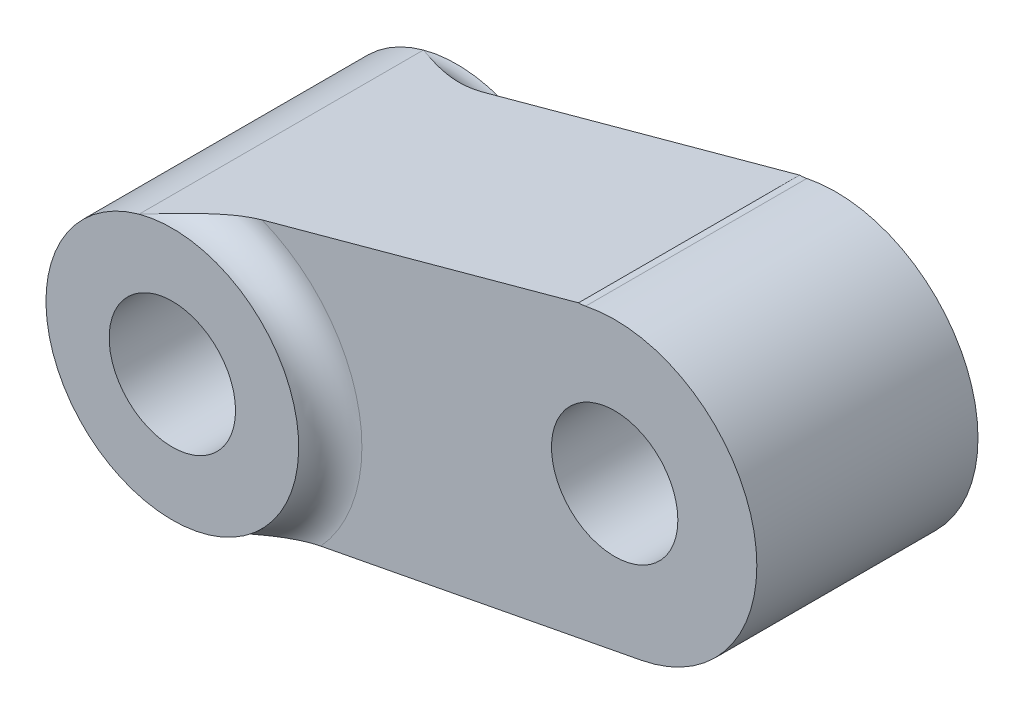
ISO-10303-21;
HEADER;
FILE_DESCRIPTION(('STEP AP214'),'2;1');
FILE_NAME('part.step','',(''),(''),'','','');
FILE_SCHEMA(('AUTOMOTIVE_DESIGN { 1 0 10303 214 1 1 1 1 }'));
ENDSEC;
DATA;
#1=APPLICATION_CONTEXT('core data for automotive mechanical design processes');
#2=APPLICATION_PROTOCOL_DEFINITION('international standard','automotive_design',2000,#1);
#3=PRODUCT_CONTEXT('',#1,'mechanical');
#4=PRODUCT('Part','Part','',(#3));
#5=PRODUCT_RELATED_PRODUCT_CATEGORY('part','',(#4));
#6=PRODUCT_DEFINITION_FORMATION('','',#4);
#7=PRODUCT_DEFINITION_CONTEXT('part definition',#1,'design');
#8=PRODUCT_DEFINITION('design','',#6,#7);
#9=PRODUCT_DEFINITION_SHAPE('','',#8);
#10=(LENGTH_UNIT() NAMED_UNIT(*) SI_UNIT(.MILLI.,.METRE.));
#11=(NAMED_UNIT(*) PLANE_ANGLE_UNIT() SI_UNIT($,.RADIAN.));
#12=(NAMED_UNIT(*) SI_UNIT($,.STERADIAN.) SOLID_ANGLE_UNIT());
#13=UNCERTAINTY_MEASURE_WITH_UNIT(LENGTH_MEASURE(1.E-05),#10,'distance_accuracy_value','');
#14=(GEOMETRIC_REPRESENTATION_CONTEXT(3) GLOBAL_UNCERTAINTY_ASSIGNED_CONTEXT((#13)) GLOBAL_UNIT_ASSIGNED_CONTEXT((#10,
#11,#12)) REPRESENTATION_CONTEXT('',''));
#15=CARTESIAN_POINT('',(0.,0.,0.));
#16=DIRECTION('',(0.,0.,1.));
#17=DIRECTION('',(1.,0.,0.));
#18=AXIS2_PLACEMENT_3D('',#15,#16,#17);
#19=CARTESIAN_POINT('',(-3.,-26.,-7.));
#20=DIRECTION('',(0.,0.,1.));
#21=DIRECTION('',(1.,0.,0.));
#22=AXIS2_PLACEMENT_3D('',#19,#20,#21);
#23=CYLINDRICAL_SURFACE('',#22,8.);
#24=CARTESIAN_POINT('',(-3.,-26.,-9.));
#25=DIRECTION('',(0.,0.,-1.));
#26=DIRECTION('',(-1.,0.,0.));
#27=AXIS2_PLACEMENT_3D('',#24,#25,#26);
#28=CIRCLE('',#27,8.);
#29=CARTESIAN_POINT('',(-1.49452247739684,-33.8570692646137,-9.));
#30=VERTEX_POINT('',#29);
#31=CARTESIAN_POINT('',(-5.10755430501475,-18.2826031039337,-9.));
#32=VERTEX_POINT('',#31);
#33=EDGE_CURVE('E210',#30,#32,#28,.T.);
#34=ORIENTED_EDGE('',*,*,#33,.F.);
#35=DIRECTION('',(0.,0.,1.));
#36=VECTOR('',#35,1.);
#37=CARTESIAN_POINT('',(-1.49452247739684,-33.8570692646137,-7.));
#38=LINE('',#37,#36);
#39=CARTESIAN_POINT('',(-1.49452247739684,-33.8570692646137,9.));
#40=VERTEX_POINT('',#39);
#41=EDGE_CURVE('E122',#30,#40,#38,.T.);
#42=ORIENTED_EDGE('',*,*,#41,.T.);
#43=CARTESIAN_POINT('',(-3.,-26.,9.));
#44=DIRECTION('',(0.,0.,1.));
#45=DIRECTION('',(1.,0.,0.));
#46=AXIS2_PLACEMENT_3D('',#43,#44,#45);
#47=CIRCLE('',#46,8.);
#48=CARTESIAN_POINT('',(-5.10755430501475,-18.2826031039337,8.99999999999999));
#49=VERTEX_POINT('',#48);
#50=EDGE_CURVE('E255',#49,#40,#47,.T.);
#51=ORIENTED_EDGE('',*,*,#50,.F.);
#52=DIRECTION('',(0.,0.,1.));
#53=VECTOR('',#52,1.);
#54=CARTESIAN_POINT('',(-5.10755430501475,-18.2826031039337,-10.5));
#55=LINE('',#54,#53);
#56=EDGE_CURVE('E216',#32,#49,#55,.T.);
#57=ORIENTED_EDGE('',*,*,#56,.F.);
#58=EDGE_LOOP('',(#34,#42,#51,#57));
#59=FACE_BOUND('',#58,.T.);
#60=CARTESIAN_POINT('',(-10.99397486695,-25.6895715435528,0.));
#61=CARTESIAN_POINT('',(-10.9939762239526,-25.6895748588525,-0.115755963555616));
#62=CARTESIAN_POINT('',(-10.9943801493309,-25.6995211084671,-0.231543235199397));
#63=CARTESIAN_POINT('',(-10.9957621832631,-25.7389201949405,-0.459778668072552));
#64=CARTESIAN_POINT('',(-10.9967405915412,-25.7683832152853,-0.572225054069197));
#65=CARTESIAN_POINT('',(-10.9986031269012,-25.8456383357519,-0.790444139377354));
#66=CARTESIAN_POINT('',(-10.9994873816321,-25.8934052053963,-0.896225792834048));
#67=CARTESIAN_POINT('',(-11.0001939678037,-26.0056160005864,-1.09852786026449));
#68=CARTESIAN_POINT('',(-11.0000162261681,-26.0700610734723,-1.19504763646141));
#69=CARTESIAN_POINT('',(-10.997440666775,-26.2152016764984,-1.37842600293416));
#70=CARTESIAN_POINT('',(-10.9949943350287,-26.2962220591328,-1.46502684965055));
#71=CARTESIAN_POINT('',(-10.9865919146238,-26.4711767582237,-1.62383259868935));
#72=CARTESIAN_POINT('',(-10.9806354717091,-26.5651123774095,-1.69603604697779));
#73=CARTESIAN_POINT('',(-10.9640028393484,-26.7647413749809,-1.82506701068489));
#74=CARTESIAN_POINT('',(-10.9532549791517,-26.870594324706,-1.88163906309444));
#75=CARTESIAN_POINT('',(-10.9262096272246,-27.0896617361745,-1.97613660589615));
#76=CARTESIAN_POINT('',(-10.9099130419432,-27.2028749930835,-2.01406513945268));
#77=CARTESIAN_POINT('',(-10.871873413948,-27.4306061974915,-2.06936702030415));
#78=CARTESIAN_POINT('',(-10.8502595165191,-27.5450391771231,-2.08717861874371));
#79=CARTESIAN_POINT('',(-10.801676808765,-27.7741307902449,-2.10311903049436));
#80=CARTESIAN_POINT('',(-10.7747088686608,-27.8887893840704,-2.10125103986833));
#81=CARTESIAN_POINT('',(-10.7169860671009,-28.1121349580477,-2.07819560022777));
#82=CARTESIAN_POINT('',(-10.6863398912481,-28.2208993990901,-2.05748152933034));
#83=CARTESIAN_POINT('',(-10.6220320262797,-28.4324595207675,-1.99808569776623));
#84=CARTESIAN_POINT('',(-10.5883701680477,-28.5352548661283,-1.95940292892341));
#85=CARTESIAN_POINT('',(-10.5193253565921,-28.733287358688,-1.86479982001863));
#86=CARTESIAN_POINT('',(-10.4839288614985,-28.8284413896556,-1.80871569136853));
#87=CARTESIAN_POINT('',(-10.4136238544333,-29.0079036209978,-1.68102721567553));
#88=CARTESIAN_POINT('',(-10.3787154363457,-29.0922097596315,-1.60941992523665));
#89=CARTESIAN_POINT('',(-10.3104026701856,-29.2504881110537,-1.45019850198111));
#90=CARTESIAN_POINT('',(-10.2770740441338,-29.3240779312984,-1.36217128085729));
#91=CARTESIAN_POINT('',(-10.2152766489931,-29.456170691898,-1.17391918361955));
#92=CARTESIAN_POINT('',(-10.1868081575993,-29.5146727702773,-1.07369361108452));
#93=CARTESIAN_POINT('',(-10.1366344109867,-29.6154740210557,-0.863065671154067));
#94=CARTESIAN_POINT('',(-10.1149694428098,-29.6576770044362,-0.752607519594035));
#95=CARTESIAN_POINT('',(-10.0803585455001,-29.7242376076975,-0.525145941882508));
#96=CARTESIAN_POINT('',(-10.0674105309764,-29.7485994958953,-0.408144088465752));
#97=CARTESIAN_POINT('',(-10.0515625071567,-29.7783255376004,-0.174552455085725));
#98=CARTESIAN_POINT('',(-10.0483820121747,-29.7842201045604,-0.0580491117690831));
#99=CARTESIAN_POINT('',(-10.0515371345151,-29.7783376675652,0.174372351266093));
#100=CARTESIAN_POINT('',(-10.0578717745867,-29.7665624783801,0.290290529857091));
#101=CARTESIAN_POINT('',(-10.0793283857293,-29.7260720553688,0.516037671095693));
#102=CARTESIAN_POINT('',(-10.0942858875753,-29.6976737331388,0.625939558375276));
#103=CARTESIAN_POINT('',(-10.1317198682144,-29.6249460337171,0.838978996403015));
#104=CARTESIAN_POINT('',(-10.1541973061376,-29.5806146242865,0.942115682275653));
#105=CARTESIAN_POINT('',(-10.2056299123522,-29.4759683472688,1.14113113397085));
#106=CARTESIAN_POINT('',(-10.2347133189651,-29.415331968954,1.23680754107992));
#107=CARTESIAN_POINT('',(-10.2971067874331,-29.2799054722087,1.41600335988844));
#108=CARTESIAN_POINT('',(-10.3304176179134,-29.2051127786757,1.49952055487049));
#109=CARTESIAN_POINT('',(-10.4001524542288,-29.0407106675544,1.65441955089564));
#110=CARTESIAN_POINT('',(-10.4366373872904,-28.9507460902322,1.72539777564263));
#111=CARTESIAN_POINT('',(-10.5096464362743,-28.7596479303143,1.85025276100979));
#112=CARTESIAN_POINT('',(-10.5461705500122,-28.6585149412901,1.9041304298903));
#113=CARTESIAN_POINT('',(-10.6169169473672,-28.4484194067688,1.99276634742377));
#114=CARTESIAN_POINT('',(-10.651154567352,-28.3395219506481,2.02766628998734));
#115=CARTESIAN_POINT('',(-10.7158968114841,-28.1162307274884,2.07777115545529));
#116=CARTESIAN_POINT('',(-10.7464022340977,-28.0018381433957,2.09298029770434));
#117=CARTESIAN_POINT('',(-10.8015901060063,-27.7743962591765,2.10301433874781));
#118=CARTESIAN_POINT('',(-10.8264187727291,-27.6614082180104,2.09843212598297));
#119=CARTESIAN_POINT('',(-10.8707600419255,-27.4367488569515,2.07038539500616));
#120=CARTESIAN_POINT('',(-10.8902728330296,-27.3250774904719,2.04692154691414));
#121=CARTESIAN_POINT('',(-10.923800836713,-27.1070150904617,1.98210858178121));
#122=CARTESIAN_POINT('',(-10.9378508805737,-27.0005945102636,1.9408764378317));
#123=CARTESIAN_POINT('',(-10.9610504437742,-26.7952163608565,1.84180205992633));
#124=CARTESIAN_POINT('',(-10.9701992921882,-26.6962598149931,1.78395755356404));
#125=CARTESIAN_POINT('',(-10.984563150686,-26.506055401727,1.65154658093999));
#126=CARTESIAN_POINT('',(-10.9896697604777,-26.4150746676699,1.57658464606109));
#127=CARTESIAN_POINT('',(-10.9966518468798,-26.246379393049,1.4128212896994));
#128=CARTESIAN_POINT('',(-10.9985264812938,-26.168668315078,1.32401626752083));
#129=CARTESIAN_POINT('',(-11.0002724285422,-26.0273830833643,1.1328304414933));
#130=CARTESIAN_POINT('',(-11.00010058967,-25.964142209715,1.03020250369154));
#131=CARTESIAN_POINT('',(-10.9988902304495,-25.8561560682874,0.815685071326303));
#132=CARTESIAN_POINT('',(-10.9978522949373,-25.8113983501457,0.703801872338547));
#133=CARTESIAN_POINT('',(-10.9960796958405,-25.7479462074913,0.493561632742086));
#134=CARTESIAN_POINT('',(-10.9953234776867,-25.7261133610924,0.396141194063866));
#135=CARTESIAN_POINT('',(-10.9942705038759,-25.6969253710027,0.199154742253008));
#136=CARTESIAN_POINT('',(-10.9939736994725,-25.689568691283,0.0995889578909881));
#137=CARTESIAN_POINT('',(-10.99397486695,-25.6895715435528,0.));
#138=B_SPLINE_CURVE_WITH_KNOTS('',3,(#60,#61,#62,#63,#64,#65,#66,#67,#68,#69,#70,#71,#72,#73,
#74,#75,#76,#77,#78,#79,#80,#81,#82,#83,#84,#85,#86,#87,#88,#89,#90,#91,#92,#93,#94,#95,#96,#97,
#98,#99,#100,#101,#102,#103,#104,#105,#106,#107,#108,#109,#110,#111,#112,#113,#114,#115,#116,
#117,#118,#119,#120,#121,#122,#123,#124,#125,#126,#127,#128,#129,#130,#131,#132,#133,#134,#135,
#136,#137),.UNSPECIFIED.,.T.,.F.,(4,2,2,2,2,2,2,2,2,2,2,2,2,2,2,2,2,2,2,2,2,2,2,2,2,2,2,2,2,2,2,
2,2,2,2,2,2,2,4),(0.,0.346901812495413,0.693984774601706,1.04059102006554,1.38722111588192,
1.74143920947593,2.09569305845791,2.4554336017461,2.8151154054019,3.1668004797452,
3.51842843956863,3.86146089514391,4.20451259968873,4.55089656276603,4.89734626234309,
5.25411055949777,5.6108952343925,5.96975442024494,6.32852772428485,6.67689726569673,
7.02523103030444,7.36713083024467,7.70907425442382,8.05832960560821,8.40764854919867,
8.76671324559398,9.1257588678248,9.48208558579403,9.83833593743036,10.1839893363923,
10.5296304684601,10.8730301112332,11.2164767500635,11.5688480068,11.9213110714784,
12.2812190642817,12.6408842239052,12.9393678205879,13.237819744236),.UNSPECIFIED.);
#139=CARTESIAN_POINT('',(-10.99397486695,-25.6895715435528,0.));
#140=VERTEX_POINT('',#139);
#141=EDGE_CURVE('E214',#140,#140,#138,.T.);
#142=ORIENTED_EDGE('',*,*,#141,.F.);
#143=EDGE_LOOP('',(#142));
#144=FACE_BOUND('',#143,.T.);
#145=ADVANCED_FACE('F36',(#59,#144),#23,.T.);
#146=CARTESIAN_POINT('',(-3.,-26.,-7.));
#147=DIRECTION('',(0.,0.,1.));
#148=DIRECTION('',(1.,0.,0.));
#149=AXIS2_PLACEMENT_3D('',#146,#147,#148);
#150=CYLINDRICAL_SURFACE('',#149,4.);
#151=CARTESIAN_POINT('',(-3.,-26.,-9.));
#152=DIRECTION('',(0.,0.,-1.));
#153=DIRECTION('',(-1.,0.,0.));
#154=AXIS2_PLACEMENT_3D('',#151,#152,#153);
#155=CIRCLE('',#154,4.);
#156=CARTESIAN_POINT('',(-7.,-26.,-9.));
#157=VERTEX_POINT('',#156);
#158=EDGE_CURVE('E161',#157,#157,#155,.T.);
#159=ORIENTED_EDGE('',*,*,#158,.T.);
#160=EDGE_LOOP('',(#159));
#161=FACE_BOUND('',#160,.T.);
#162=CARTESIAN_POINT('',(-3.,-26.,9.));
#163=DIRECTION('',(0.,0.,1.));
#164=DIRECTION('',(1.,0.,0.));
#165=AXIS2_PLACEMENT_3D('',#162,#163,#164);
#166=CIRCLE('',#165,4.);
#167=CARTESIAN_POINT('',(1.,-26.,9.));
#168=VERTEX_POINT('',#167);
#169=EDGE_CURVE('E287',#168,#168,#166,.T.);
#170=ORIENTED_EDGE('',*,*,#169,.T.);
#171=EDGE_LOOP('',(#170));
#172=FACE_BOUND('',#171,.T.);
#173=CARTESIAN_POINT('',(-6.78943102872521,-24.7192921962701,0.));
#174=CARTESIAN_POINT('',(-6.78944072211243,-24.7193041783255,-0.108548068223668));
#175=CARTESIAN_POINT('',(-6.79266317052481,-24.7287351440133,-0.217217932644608));
#176=CARTESIAN_POINT('',(-6.80488966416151,-24.7658325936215,-0.431148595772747));
#177=CARTESIAN_POINT('',(-6.81390463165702,-24.79353352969,-0.536402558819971));
#178=CARTESIAN_POINT('',(-6.83585737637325,-24.8652827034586,-0.739996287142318));
#179=CARTESIAN_POINT('',(-6.84877250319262,-24.9092368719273,-0.838372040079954));
#180=CARTESIAN_POINT('',(-6.8763069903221,-25.0115452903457,-1.02699973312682));
#181=CARTESIAN_POINT('',(-6.89092658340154,-25.0699015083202,-1.11725056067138));
#182=CARTESIAN_POINT('',(-6.92088933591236,-25.2051152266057,-1.29616635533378));
#183=CARTESIAN_POINT('',(-6.9361763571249,-25.2831768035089,-1.38393111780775));
#184=CARTESIAN_POINT('',(-6.96323436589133,-25.4521848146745,-1.54674576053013));
#185=CARTESIAN_POINT('',(-6.97500344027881,-25.5431382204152,-1.6217887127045));
#186=CARTESIAN_POINT('',(-6.99310282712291,-25.7431850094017,-1.76264383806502));
#187=CARTESIAN_POINT('',(-6.9989503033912,-25.8531325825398,-1.82731670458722));
#188=CARTESIAN_POINT('',(-7.00078934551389,-26.0823259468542,-1.93752728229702));
#189=CARTESIAN_POINT('',(-6.99678777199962,-26.2015652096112,-1.98307828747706));
#190=CARTESIAN_POINT('',(-6.97778361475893,-26.4358512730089,-2.05007898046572));
#191=CARTESIAN_POINT('',(-6.96365331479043,-26.5505121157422,-2.07311657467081));
#192=CARTESIAN_POINT('',(-6.92488012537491,-26.7802922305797,-2.09969870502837));
#193=CARTESIAN_POINT('',(-6.90024437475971,-26.8954111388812,-2.10325645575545));
#194=CARTESIAN_POINT('',(-6.84404310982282,-27.1111108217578,-2.09131480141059));
#195=CARTESIAN_POINT('',(-6.81336572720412,-27.2120290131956,-2.07760552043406));
#196=CARTESIAN_POINT('',(-6.74537242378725,-27.4081766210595,-2.03476862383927));
#197=CARTESIAN_POINT('',(-6.70805600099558,-27.5034056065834,-2.00563984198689));
#198=CARTESIAN_POINT('',(-6.62814684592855,-27.6872259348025,-1.93268735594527));
#199=CARTESIAN_POINT('',(-6.58549386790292,-27.7757191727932,-1.88868412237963));
#200=CARTESIAN_POINT('',(-6.49749218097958,-27.9433275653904,-1.7875248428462));
#201=CARTESIAN_POINT('',(-6.45214255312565,-28.0224394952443,-1.73036429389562));
#202=CARTESIAN_POINT('',(-6.35646219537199,-28.177915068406,-1.59788528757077));
#203=CARTESIAN_POINT('',(-6.30609249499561,-28.253187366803,-1.52131360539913));
#204=CARTESIAN_POINT('',(-6.20815504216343,-28.3905803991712,-1.3555002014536));
#205=CARTESIAN_POINT('',(-6.16058985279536,-28.4526892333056,-1.2662471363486));
#206=CARTESIAN_POINT('',(-6.06846545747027,-28.5671612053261,-1.06946146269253));
#207=CARTESIAN_POINT('',(-6.02440068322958,-28.6184413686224,-0.961059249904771));
#208=CARTESIAN_POINT('',(-5.94838265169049,-28.703762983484,-0.733737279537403));
#209=CARTESIAN_POINT('',(-5.91641588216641,-28.7378236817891,-0.614829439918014));
#210=CARTESIAN_POINT('',(-5.87091447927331,-28.7854735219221,-0.379904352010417));
#211=CARTESIAN_POINT('',(-5.8560971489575,-28.8004967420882,-0.264432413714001));
#212=CARTESIAN_POINT('',(-5.84256309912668,-28.8142402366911,-0.0316270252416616));
#213=CARTESIAN_POINT('',(-5.84383198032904,-28.8129750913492,0.0857046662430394));
#214=CARTESIAN_POINT('',(-5.86104649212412,-28.795444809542,0.303004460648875));
#215=CARTESIAN_POINT('',(-5.8751147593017,-28.781097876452,0.403291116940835));
#216=CARTESIAN_POINT('',(-5.91377532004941,-28.7405641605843,0.599331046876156));
#217=CARTESIAN_POINT('',(-5.93837153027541,-28.7143729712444,0.695082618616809));
#218=CARTESIAN_POINT('',(-5.99713268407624,-28.6493750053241,0.884292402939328));
#219=CARTESIAN_POINT('',(-6.03167880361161,-28.6100530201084,0.977452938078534));
#220=CARTESIAN_POINT('',(-6.10703172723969,-28.5198819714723,1.15527125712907));
#221=CARTESIAN_POINT('',(-6.14784173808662,-28.469026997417,1.23992464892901));
#222=CARTESIAN_POINT('',(-6.23911414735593,-28.3483262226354,1.4108916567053));
#223=CARTESIAN_POINT('',(-6.29012482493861,-28.2768104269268,1.49574026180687));
#224=CARTESIAN_POINT('',(-6.39317946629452,-28.1201707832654,1.65113739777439));
#225=CARTESIAN_POINT('',(-6.44522388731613,-28.035040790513,1.72167943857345));
#226=CARTESIAN_POINT('',(-6.54877547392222,-27.8487700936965,1.8488209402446));
#227=CARTESIAN_POINT('',(-6.60018966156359,-27.7471494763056,1.90479990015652));
#228=CARTESIAN_POINT('',(-6.6966536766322,-27.5324964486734,1.99677749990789));
#229=CARTESIAN_POINT('',(-6.74170959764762,-27.4194751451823,2.0327953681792));
#230=CARTESIAN_POINT('',(-6.81838746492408,-27.1968341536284,2.08044590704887));
#231=CARTESIAN_POINT('',(-6.8508896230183,-27.0879520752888,2.09410893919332));
#232=CARTESIAN_POINT('',(-6.90654015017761,-26.8671139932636,2.10281684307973));
#233=CARTESIAN_POINT('',(-6.9296925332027,-26.7551593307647,2.09786971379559));
#234=CARTESIAN_POINT('',(-6.96467235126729,-26.5406317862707,2.07075138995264));
#235=CARTESIAN_POINT('',(-6.97723580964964,-26.4380015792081,2.0499387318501));
#236=CARTESIAN_POINT('',(-6.99430614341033,-26.2361785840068,1.99363635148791));
#237=CARTESIAN_POINT('',(-6.9988119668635,-26.1369862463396,1.95814471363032));
#238=CARTESIAN_POINT('',(-7.00081210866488,-25.9406634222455,1.87210834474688));
#239=CARTESIAN_POINT('',(-6.99802450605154,-25.8437663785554,1.82102782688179));
#240=CARTESIAN_POINT('',(-6.98647003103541,-25.6583912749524,1.70592534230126));
#241=CARTESIAN_POINT('',(-6.97770051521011,-25.5699169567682,1.64189766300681));
#242=CARTESIAN_POINT('',(-6.95494971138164,-25.3941574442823,1.49475029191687));
#243=CARTESIAN_POINT('',(-6.94050849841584,-25.308028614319,1.41031652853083));
#244=CARTESIAN_POINT('',(-6.90957214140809,-25.1504675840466,1.22889737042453));
#245=CARTESIAN_POINT('',(-6.89307487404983,-25.0790507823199,1.13189899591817));
#246=CARTESIAN_POINT('',(-6.86043928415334,-24.9504087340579,0.922020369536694));
#247=CARTESIAN_POINT('',(-6.84435620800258,-24.8940293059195,0.808601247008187));
#248=CARTESIAN_POINT('',(-6.82395750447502,-24.8261600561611,0.631942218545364));
#249=CARTESIAN_POINT('',(-6.81778270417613,-24.8063303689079,0.572022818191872));
#250=CARTESIAN_POINT('',(-6.80705282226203,-24.7725370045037,0.450425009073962));
#251=CARTESIAN_POINT('',(-6.802496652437,-24.758569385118,0.388747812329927));
#252=CARTESIAN_POINT('',(-6.79580705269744,-24.7382759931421,0.272663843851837));
#253=CARTESIAN_POINT('',(-6.7934287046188,-24.7311702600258,0.218406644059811));
#254=CARTESIAN_POINT('',(-6.79023820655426,-24.7216752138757,0.109443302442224));
#255=CARTESIAN_POINT('',(-6.78942614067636,-24.719286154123,0.0547371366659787));
#256=CARTESIAN_POINT('',(-6.78943102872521,-24.7192921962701,0.));
#257=B_SPLINE_CURVE_WITH_KNOTS('',3,(#173,#174,#175,#176,#177,#178,#179,#180,#181,#182,#183,
#184,#185,#186,#187,#188,#189,#190,#191,#192,#193,#194,#195,#196,#197,#198,#199,#200,#201,#202,
#203,#204,#205,#206,#207,#208,#209,#210,#211,#212,#213,#214,#215,#216,#217,#218,#219,#220,#221,
#222,#223,#224,#225,#226,#227,#228,#229,#230,#231,#232,#233,#234,#235,#236,#237,#238,#239,#240,
#241,#242,#243,#244,#245,#246,#247,#248,#249,#250,#251,#252,#253,#254,#255,#256),.UNSPECIFIED.,
.T.,.F.,(4,2,2,2,2,2,2,2,2,2,2,2,2,2,2,2,2,2,2,2,2,2,2,2,2,2,2,2,2,2,2,2,2,2,2,2,2,2,2,2,2,4),
(0.,0.325421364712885,0.651458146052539,0.975636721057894,1.29985961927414,1.65373988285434,
2.00781224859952,2.38886816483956,2.76965872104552,3.1210798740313,3.4722626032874,
3.78985744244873,4.10747630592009,4.42907437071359,4.75078266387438,5.10509921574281,
5.45973471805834,5.84101781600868,6.22187379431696,6.57189687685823,6.92160666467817,
7.22706767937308,7.53264243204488,7.85198426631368,8.17149013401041,8.53627740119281,
8.90122978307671,9.2798385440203,9.65808195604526,9.99955115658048,10.3408736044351,
10.6558582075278,10.9708839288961,11.2982649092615,11.6257906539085,11.9886241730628,
12.3518355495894,12.732482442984,12.9224733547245,13.1123362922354,13.2764265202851,
13.4405255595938),.UNSPECIFIED.);
#258=CARTESIAN_POINT('',(-6.78943102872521,-24.7192921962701,0.));
#259=VERTEX_POINT('',#258);
#260=EDGE_CURVE('E217',#259,#259,#257,.T.);
#261=ORIENTED_EDGE('',*,*,#260,.T.);
#262=EDGE_LOOP('',(#261));
#263=FACE_BOUND('',#262,.T.);
#264=ADVANCED_FACE('F193',(#161,#172,#263),#150,.F.);
#265=CARTESIAN_POINT('',(-3.,-26.,-7.));
#266=DIRECTION('',(0.,0.,1.));
#267=DIRECTION('',(1.,0.,0.));
#268=AXIS2_PLACEMENT_3D('',#265,#266,#267);
#269=PLANE('',#268);
#270=CARTESIAN_POINT('',(23.,-20.,-7.));
#271=DIRECTION('',(0.,0.,1.));
#272=DIRECTION('',(1.,0.,0.));
#273=AXIS2_PLACEMENT_3D('',#270,#271,#272);
#274=CIRCLE('',#273,4.);
#275=CARTESIAN_POINT('',(27.,-20.,-7.));
#276=VERTEX_POINT('',#275);
#277=EDGE_CURVE('E249',#276,#276,#274,.T.);
#278=ORIENTED_EDGE('',*,*,#277,.T.);
#279=EDGE_LOOP('',(#278));
#280=FACE_BOUND('',#279,.T.);
#281=CARTESIAN_POINT('',(-3.,-26.,-7.));
#282=DIRECTION('',(0.,0.,1.));
#283=DIRECTION('',(1.,0.,0.));
#284=AXIS2_PLACEMENT_3D('',#281,#282,#283);
#285=CIRCLE('',#284,10.);
#286=CARTESIAN_POINT('',(4.3982794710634,-32.7279611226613,-7.));
#287=VERTEX_POINT('',#286);
#288=CARTESIAN_POINT('',(0.680493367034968,-16.7019373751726,-7.));
#289=VERTEX_POINT('',#288);
#290=EDGE_CURVE('E117',#287,#289,#285,.T.);
#291=ORIENTED_EDGE('',*,*,#290,.T.);
#292=DIRECTION('',(0.964674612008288,0.263444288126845,0.));
#293=VECTOR('',#292,1.);
#294=CARTESIAN_POINT('',(-5.10755430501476,-18.2826031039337,-7.));
#295=LINE('',#294,#293);
#296=CARTESIAN_POINT('',(20.7127394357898,-11.2313043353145,-7.));
#297=VERTEX_POINT('',#296);
#298=EDGE_CURVE('E278',#289,#297,#295,.T.);
#299=ORIENTED_EDGE('',*,*,#298,.T.);
#300=CARTESIAN_POINT('',(20.7540314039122,-9.23173063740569,-7.));
#301=DIRECTION('',(0.,0.,1.));
#302=DIRECTION('',(1.,0.,0.));
#303=AXIS2_PLACEMENT_3D('',#300,#301,#302);
#304=CIRCLE('',#303,2.);
#305=CARTESIAN_POINT('',(21.1623893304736,-11.189597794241,-7.));
#306=VERTEX_POINT('',#305);
#307=EDGE_CURVE('E44',#297,#306,#304,.T.);
#308=ORIENTED_EDGE('',*,*,#307,.T.);
#309=CARTESIAN_POINT('',(23.,-20.,-7.));
#310=DIRECTION('',(0.,0.,1.));
#311=DIRECTION('',(1.,0.,0.));
#312=AXIS2_PLACEMENT_3D('',#309,#310,#311);
#313=CIRCLE('',#312,9.);
#314=CARTESIAN_POINT('',(24.6936622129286,-28.8392029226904,-7.));
#315=VERTEX_POINT('',#314);
#316=EDGE_CURVE('E125',#315,#306,#313,.T.);
#317=ORIENTED_EDGE('',*,*,#316,.F.);
#318=DIRECTION('',(0.982133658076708,0.188184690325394,0.));
#319=VECTOR('',#318,1.);
#320=CARTESIAN_POINT('',(-1.49452247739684,-33.8570692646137,-7.));
#321=LINE('',#320,#319);
#322=EDGE_CURVE('E116',#287,#315,#321,.T.);
#323=ORIENTED_EDGE('',*,*,#322,.F.);
#324=EDGE_LOOP('',(#291,#299,#308,#317,#323));
#325=FACE_BOUND('',#324,.T.);
#326=ADVANCED_FACE('F188',(#280,#325),#269,.F.);
#327=CARTESIAN_POINT('',(-3.,-26.,7.));
#328=DIRECTION('',(0.,0.,1.));
#329=DIRECTION('',(1.,0.,0.));
#330=AXIS2_PLACEMENT_3D('',#327,#328,#329);
#331=PLANE('',#330);
#332=DIRECTION('',(0.964674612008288,0.263444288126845,0.));
#333=VECTOR('',#332,1.);
#334=CARTESIAN_POINT('',(-5.10755430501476,-18.2826031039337,7.));
#335=LINE('',#334,#333);
#336=CARTESIAN_POINT('',(0.680493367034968,-16.7019373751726,7.));
#337=VERTEX_POINT('',#336);
#338=CARTESIAN_POINT('',(20.7127394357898,-11.2313043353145,7.));
#339=VERTEX_POINT('',#338);
#340=EDGE_CURVE('E58',#337,#339,#335,.T.);
#341=ORIENTED_EDGE('',*,*,#340,.F.);
#342=CARTESIAN_POINT('',(-3.,-26.,7.));
#343=DIRECTION('',(0.,0.,1.));
#344=DIRECTION('',(1.,0.,0.));
#345=AXIS2_PLACEMENT_3D('',#342,#343,#344);
#346=CIRCLE('',#345,10.);
#347=CARTESIAN_POINT('',(4.3982794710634,-32.7279611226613,7.));
#348=VERTEX_POINT('',#347);
#349=EDGE_CURVE('E120',#337,#348,#346,.F.);
#350=ORIENTED_EDGE('',*,*,#349,.T.);
#351=DIRECTION('',(0.982133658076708,0.188184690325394,0.));
#352=VECTOR('',#351,1.);
#353=CARTESIAN_POINT('',(-1.49452247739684,-33.8570692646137,7.));
#354=LINE('',#353,#352);
#355=CARTESIAN_POINT('',(24.6936622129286,-28.8392029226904,7.));
#356=VERTEX_POINT('',#355);
#357=EDGE_CURVE('E254',#348,#356,#354,.T.);
#358=ORIENTED_EDGE('',*,*,#357,.T.);
#359=CARTESIAN_POINT('',(23.,-20.,7.));
#360=DIRECTION('',(0.,0.,1.));
#361=DIRECTION('',(1.,0.,0.));
#362=AXIS2_PLACEMENT_3D('',#359,#360,#361);
#363=CIRCLE('',#362,9.);
#364=CARTESIAN_POINT('',(21.1623893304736,-11.189597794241,7.));
#365=VERTEX_POINT('',#364);
#366=EDGE_CURVE('E258',#356,#365,#363,.T.);
#367=ORIENTED_EDGE('',*,*,#366,.T.);
#368=CARTESIAN_POINT('',(20.7540314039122,-9.23173063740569,7.));
#369=DIRECTION('',(0.,0.,1.));
#370=DIRECTION('',(1.,0.,0.));
#371=AXIS2_PLACEMENT_3D('',#368,#369,#370);
#372=CIRCLE('',#371,2.);
#373=EDGE_CURVE('E274',#365,#339,#372,.F.);
#374=ORIENTED_EDGE('',*,*,#373,.T.);
#375=EDGE_LOOP('',(#341,#350,#358,#367,#374));
#376=FACE_BOUND('',#375,.T.);
#377=CARTESIAN_POINT('',(23.,-20.,7.));
#378=DIRECTION('',(0.,0.,1.));
#379=DIRECTION('',(1.,0.,0.));
#380=AXIS2_PLACEMENT_3D('',#377,#378,#379);
#381=CIRCLE('',#380,4.);
#382=CARTESIAN_POINT('',(27.,-20.,7.));
#383=VERTEX_POINT('',#382);
#384=EDGE_CURVE('E252',#383,#383,#381,.T.);
#385=ORIENTED_EDGE('',*,*,#384,.F.);
#386=EDGE_LOOP('',(#385));
#387=FACE_BOUND('',#386,.T.);
#388=ADVANCED_FACE('F185',(#376,#387),#331,.T.);
#389=CARTESIAN_POINT('',(23.,-20.,-7.));
#390=DIRECTION('',(0.,0.,1.));
#391=DIRECTION('',(1.,0.,0.));
#392=AXIS2_PLACEMENT_3D('',#389,#390,#391);
#393=CYLINDRICAL_SURFACE('',#392,9.);
#394=CARTESIAN_POINT('',(24.6936622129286,-28.8392029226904,2.5));
#395=CARTESIAN_POINT('',(24.7613428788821,-28.8262423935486,2.50000818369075));
#396=CARTESIAN_POINT('',(24.8288670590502,-28.8124909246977,2.49715094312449));
#397=CARTESIAN_POINT('',(24.9631141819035,-28.7835563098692,2.48576912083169));
#398=CARTESIAN_POINT('',(25.0298372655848,-28.7683734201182,2.4772455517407));
#399=CARTESIAN_POINT('',(25.1618760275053,-28.7367555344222,2.45461894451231));
#400=CARTESIAN_POINT('',(25.2271944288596,-28.7203233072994,2.44052796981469));
#401=CARTESIAN_POINT('',(25.3561078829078,-28.6863805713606,2.40690029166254));
#402=CARTESIAN_POINT('',(25.4197029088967,-28.6688700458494,2.387363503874));
#403=CARTESIAN_POINT('',(25.6072483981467,-28.6150505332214,2.32080662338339));
#404=CARTESIAN_POINT('',(25.728098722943,-28.5774197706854,2.26581586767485));
#405=CARTESIAN_POINT('',(25.9582871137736,-28.5007831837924,2.13630512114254));
#406=CARTESIAN_POINT('',(26.0676214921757,-28.4617769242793,2.06177890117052));
#407=CARTESIAN_POINT('',(26.2747021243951,-28.3838437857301,1.89334530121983));
#408=CARTESIAN_POINT('',(26.3721352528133,-28.3449381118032,1.7990424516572));
#409=CARTESIAN_POINT('',(26.5503235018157,-28.2707040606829,1.59457426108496));
#410=CARTESIAN_POINT('',(26.6310751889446,-28.2353764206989,1.48440566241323));
#411=CARTESIAN_POINT('',(26.77538464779,-28.1702432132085,1.24878266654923));
#412=CARTESIAN_POINT('',(26.8385899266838,-28.1405541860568,1.12307944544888));
#413=CARTESIAN_POINT('',(26.9440585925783,-28.0899843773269,0.861529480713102));
#414=CARTESIAN_POINT('',(26.9863272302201,-28.069101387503,0.725685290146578));
#415=CARTESIAN_POINT('',(27.0479192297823,-28.0383777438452,0.45119593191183));
#416=CARTESIAN_POINT('',(27.0677760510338,-28.0282806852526,0.312699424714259));
#417=CARTESIAN_POINT('',(27.0857473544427,-28.0191507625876,0.0339513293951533));
#418=CARTESIAN_POINT('',(27.0838657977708,-28.0201158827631,-0.106299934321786));
#419=CARTESIAN_POINT('',(27.058822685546,-28.0328161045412,-0.380045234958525));
#420=CARTESIAN_POINT('',(27.0363113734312,-28.0442221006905,-0.513614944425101));
#421=CARTESIAN_POINT('',(26.9715818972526,-28.0763748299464,-0.774708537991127));
#422=CARTESIAN_POINT('',(26.929362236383,-28.097122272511,-0.902231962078));
#423=CARTESIAN_POINT('',(26.8257060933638,-28.1466123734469,-1.14940557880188));
#424=CARTESIAN_POINT('',(26.7640433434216,-28.1754487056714,-1.2689418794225));
#425=CARTESIAN_POINT('',(26.6231462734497,-28.2388569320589,-1.495485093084));
#426=CARTESIAN_POINT('',(26.5439085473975,-28.2734299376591,-1.60248957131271));
#427=CARTESIAN_POINT('',(26.3664897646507,-28.3472320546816,-1.80491706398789));
#428=CARTESIAN_POINT('',(26.2677370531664,-28.3865827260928,-1.8997954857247));
#429=CARTESIAN_POINT('',(26.055441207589,-28.4662335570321,-2.07083572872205));
#430=CARTESIAN_POINT('',(25.9418943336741,-28.5065339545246,-2.14699280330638));
#431=CARTESIAN_POINT('',(25.7020762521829,-28.585733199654,-2.27870390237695));
#432=CARTESIAN_POINT('',(25.5757378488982,-28.6246230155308,-2.33414109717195));
#433=CARTESIAN_POINT('',(25.3142785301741,-28.6984177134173,-2.42190972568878));
#434=CARTESIAN_POINT('',(25.1791707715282,-28.7333283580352,-2.45427493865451));
#435=CARTESIAN_POINT('',(24.9843407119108,-28.77871906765,-2.48302920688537));
#436=CARTESIAN_POINT('',(24.9265013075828,-28.7915940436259,-2.48939365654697));
#437=CARTESIAN_POINT('',(24.8103751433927,-28.8162381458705,-2.49787465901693));
#438=CARTESIAN_POINT('',(24.752089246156,-28.8280090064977,-2.4999979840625));
#439=CARTESIAN_POINT('',(24.6936622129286,-28.8392029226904,-2.50000000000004));
#440=B_SPLINE_CURVE_WITH_KNOTS('',3,(#394,#395,#396,#397,#398,#399,#400,#401,#402,#403,#404,
#405,#406,#407,#408,#409,#410,#411,#412,#413,#414,#415,#416,#417,#418,#419,#420,#421,#422,#423,
#424,#425,#426,#427,#428,#429,#430,#431,#432,#433,#434,#435,#436,#437,#438,#439),.UNSPECIFIED.,
.F.,.F.,(4,2,2,2,2,2,2,2,2,2,2,2,2,2,2,2,2,2,2,2,2,2,4),(0.,0.206659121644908,0.413281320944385,
0.619458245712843,0.825638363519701,1.23756754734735,1.64962824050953,2.07088637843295,
2.49223113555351,2.92151188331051,3.35068491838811,3.76941161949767,4.18806202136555,
4.59395428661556,4.99987738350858,5.41071049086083,5.82162328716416,6.24709344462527,
6.67267136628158,7.10061396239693,7.52792872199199,7.70658286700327,7.88495150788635),.UNSPECIFIED.);
#441=CARTESIAN_POINT('',(24.6936622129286,-28.8392029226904,2.5));
#442=VERTEX_POINT('',#441);
#443=CARTESIAN_POINT('',(24.6936622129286,-28.8392029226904,-2.5));
#444=VERTEX_POINT('',#443);
#445=EDGE_CURVE('E50',#442,#444,#440,.T.);
#446=ORIENTED_EDGE('',*,*,#445,.T.);
#447=DIRECTION('',(0.,0.,1.));
#448=VECTOR('',#447,1.);
#449=CARTESIAN_POINT('',(24.6936622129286,-28.8392029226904,-7.));
#450=LINE('',#449,#448);
#451=EDGE_CURVE('E108',#315,#444,#450,.T.);
#452=ORIENTED_EDGE('',*,*,#451,.F.);
#453=ORIENTED_EDGE('',*,*,#316,.T.);
#454=DIRECTION('',(0.,0.,1.));
#455=VECTOR('',#454,1.);
#456=CARTESIAN_POINT('',(21.1623893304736,-11.189597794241,-7.));
#457=LINE('',#456,#455);
#458=EDGE_CURVE('E269',#306,#365,#457,.T.);
#459=ORIENTED_EDGE('',*,*,#458,.T.);
#460=ORIENTED_EDGE('',*,*,#366,.F.);
#461=EDGE_CURVE('E111',#442,#356,#450,.T.);
#462=ORIENTED_EDGE('',*,*,#461,.F.);
#463=EDGE_LOOP('',(#446,#452,#453,#459,#460,#462));
#464=FACE_BOUND('',#463,.T.);
#465=ADVANCED_FACE('F106',(#464),#393,.T.);
#466=CARTESIAN_POINT('',(-1.49452247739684,-33.8570692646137,-7.));
#467=DIRECTION('',(0.188184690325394,-0.982133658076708,0.));
#468=DIRECTION('',(0.982133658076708,0.188184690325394,0.));
#469=AXIS2_PLACEMENT_3D('',#466,#467,#468);
#470=PLANE('',#469);
#471=CARTESIAN_POINT('',(24.6936622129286,-28.8392029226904,0.));
#472=DIRECTION('',(0.188184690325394,-0.982133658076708,0.));
#473=DIRECTION('',(0.982133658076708,0.188184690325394,0.));
#474=AXIS2_PLACEMENT_3D('',#471,#472,#473);
#475=CIRCLE('',#474,2.5);
#476=EDGE_CURVE('E97',#442,#444,#475,.T.);
#477=ORIENTED_EDGE('',*,*,#476,.F.);
#478=ORIENTED_EDGE('',*,*,#461,.T.);
#479=ORIENTED_EDGE('',*,*,#357,.F.);
#480=CARTESIAN_POINT('',(4.3982794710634,-32.7279611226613,7.));
#481=CARTESIAN_POINT('',(4.29411681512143,-32.7479195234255,7.00000932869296));
#482=CARTESIAN_POINT('',(4.18999500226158,-32.7678700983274,7.00303564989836));
#483=CARTESIAN_POINT('',(3.98209975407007,-32.8077044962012,7.01457198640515));
#484=CARTESIAN_POINT('',(3.8783261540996,-32.8275883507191,7.02307887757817));
#485=CARTESIAN_POINT('',(3.56838852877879,-32.8869748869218,7.05593377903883));
#486=CARTESIAN_POINT('',(3.36296231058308,-32.9263361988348,7.08762293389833));
#487=CARTESIAN_POINT('',(2.95785865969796,-33.003957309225,7.16642682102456));
#488=CARTESIAN_POINT('',(2.75814123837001,-33.0422247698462,7.21333676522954));
#489=CARTESIAN_POINT('',(2.36185475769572,-33.1181564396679,7.319828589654));
#490=CARTESIAN_POINT('',(2.16528855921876,-33.1558201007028,7.3794213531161));
#491=CARTESIAN_POINT('',(1.67202274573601,-33.2503337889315,7.54308509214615));
#492=CARTESIAN_POINT('',(1.37752496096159,-33.3067619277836,7.65398004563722));
#493=CARTESIAN_POINT('',(0.795142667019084,-33.4183510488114,7.8922217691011));
#494=CARTESIAN_POINT('',(0.507259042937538,-33.4735118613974,8.01957072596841));
#495=CARTESIAN_POINT('',(-0.351543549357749,-33.6380653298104,8.41817837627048));
#496=CARTESIAN_POINT('',(-0.91529954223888,-33.7460855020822,8.70512069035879));
#497=CARTESIAN_POINT('',(-1.48404639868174,-33.8550619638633,8.99466668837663));
#498=CARTESIAN_POINT('',(-1.48928444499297,-33.8560656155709,8.99733335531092));
#499=CARTESIAN_POINT('',(-1.49452247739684,-33.8570692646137,9.));
#500=B_SPLINE_CURVE_WITH_KNOTS('',3,(#480,#481,#482,#483,#484,#485,#486,#487,#488,#489,#490,
#491,#492,#493,#494,#495,#496,#497,#498,#499),.UNSPECIFIED.,.F.,.F.,(4,2,2,2,2,2,2,2,2,4),(0.,
0.318064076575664,0.635947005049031,1.26974999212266,1.89535644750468,2.52150192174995,
3.47983450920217,4.43829459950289,6.36273549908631,6.38062404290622),.UNSPECIFIED.);
#501=EDGE_CURVE('E136',#348,#40,#500,.T.);
#502=ORIENTED_EDGE('',*,*,#501,.T.);
#503=ORIENTED_EDGE('',*,*,#41,.F.);
#504=CARTESIAN_POINT('',(4.3982794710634,-32.7279611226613,-7.));
#505=CARTESIAN_POINT('',(4.29411681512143,-32.7479195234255,-7.00000932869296));
#506=CARTESIAN_POINT('',(4.18999500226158,-32.7678700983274,-7.00303564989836));
#507=CARTESIAN_POINT('',(3.98209975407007,-32.8077044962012,-7.01457198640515));
#508=CARTESIAN_POINT('',(3.8783261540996,-32.8275883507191,-7.02307887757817));
#509=CARTESIAN_POINT('',(3.56838852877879,-32.8869748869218,-7.05593377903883));
#510=CARTESIAN_POINT('',(3.36296231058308,-32.9263361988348,-7.08762293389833));
#511=CARTESIAN_POINT('',(2.95785865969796,-33.003957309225,-7.16642682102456));
#512=CARTESIAN_POINT('',(2.75814123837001,-33.0422247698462,-7.21333676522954));
#513=CARTESIAN_POINT('',(2.36185475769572,-33.1181564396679,-7.319828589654));
#514=CARTESIAN_POINT('',(2.16528855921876,-33.1558201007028,-7.3794213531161));
#515=CARTESIAN_POINT('',(1.67202274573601,-33.2503337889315,-7.54308509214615));
#516=CARTESIAN_POINT('',(1.37752496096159,-33.3067619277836,-7.65398004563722));
#517=CARTESIAN_POINT('',(0.795142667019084,-33.4183510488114,-7.8922217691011));
#518=CARTESIAN_POINT('',(0.507259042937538,-33.4735118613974,-8.01957072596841));
#519=CARTESIAN_POINT('',(-0.351543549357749,-33.6380653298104,-8.41817837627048));
#520=CARTESIAN_POINT('',(-0.91529954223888,-33.7460855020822,-8.70512069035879));
#521=CARTESIAN_POINT('',(-1.48404639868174,-33.8550619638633,-8.99466668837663));
#522=CARTESIAN_POINT('',(-1.48928444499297,-33.8560656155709,-8.99733335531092));
#523=CARTESIAN_POINT('',(-1.49452247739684,-33.8570692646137,-9.));
#524=B_SPLINE_CURVE_WITH_KNOTS('',3,(#504,#505,#506,#507,#508,#509,#510,#511,#512,#513,#514,
#515,#516,#517,#518,#519,#520,#521,#522,#523),.UNSPECIFIED.,.F.,.F.,(4,2,2,2,2,2,2,2,2,4),(0.,
0.318064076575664,0.635947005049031,1.26974999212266,1.89535644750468,2.52150192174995,
3.47983450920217,4.43829459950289,6.36273549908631,6.38062404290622),.UNSPECIFIED.);
#525=EDGE_CURVE('E129',#30,#287,#524,.F.);
#526=ORIENTED_EDGE('',*,*,#525,.T.);
#527=ORIENTED_EDGE('',*,*,#322,.T.);
#528=ORIENTED_EDGE('',*,*,#451,.T.);
#529=EDGE_LOOP('',(#477,#478,#479,#502,#503,#526,#527,#528));
#530=FACE_BOUND('',#529,.T.);
#531=ADVANCED_FACE('F114',(#530),#470,.T.);
#532=CARTESIAN_POINT('',(23.,-20.,-7.));
#533=DIRECTION('',(0.,0.,1.));
#534=DIRECTION('',(1.,0.,0.));
#535=AXIS2_PLACEMENT_3D('',#532,#533,#534);
#536=CYLINDRICAL_SURFACE('',#535,4.);
#537=CARTESIAN_POINT('',(26.0429406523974,-22.5962496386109,0.));
#538=CARTESIAN_POINT('',(26.0429402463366,-22.5962506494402,-0.062156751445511));
#539=CARTESIAN_POINT('',(26.0410091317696,-22.5985195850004,-0.124325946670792));
#540=CARTESIAN_POINT('',(26.0333177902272,-22.6074915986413,-0.248117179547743));
#541=CARTESIAN_POINT('',(26.0275553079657,-22.6141972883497,-0.309738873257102));
#542=CARTESIAN_POINT('',(26.0045870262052,-22.6406510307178,-0.493226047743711));
#543=CARTESIAN_POINT('',(25.981700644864,-22.6667347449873,-0.613548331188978));
#544=CARTESIAN_POINT('',(25.9220739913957,-22.731917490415,-0.845598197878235));
#545=CARTESIAN_POINT('',(25.8854537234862,-22.7709034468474,-0.957390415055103));
#546=CARTESIAN_POINT('',(25.7992726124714,-22.8579407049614,-1.17200852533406));
#547=CARTESIAN_POINT('',(25.7497114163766,-22.9059922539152,-1.27483417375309));
#548=CARTESIAN_POINT('',(25.6307393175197,-23.0143833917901,-1.48373398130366));
#549=CARTESIAN_POINT('',(25.5595574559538,-23.0755066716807,-1.58839332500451));
#550=CARTESIAN_POINT('',(25.4017751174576,-23.2002545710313,-1.78376155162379));
#551=CARTESIAN_POINT('',(25.3151613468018,-23.263881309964,-1.87445827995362));
#552=CARTESIAN_POINT('',(25.1154356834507,-23.3971981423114,-2.05022029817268));
#553=CARTESIAN_POINT('',(25.0003876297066,-23.466693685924,-2.13328618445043));
#554=CARTESIAN_POINT('',(24.8149805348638,-23.5652183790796,-2.24054515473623));
#555=CARTESIAN_POINT('',(24.7510187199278,-23.5971152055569,-2.27341513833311));
#556=CARTESIAN_POINT('',(24.6191359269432,-23.6583694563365,-2.33295468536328));
#557=CARTESIAN_POINT('',(24.5512177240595,-23.6877286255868,-2.35962853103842));
#558=CARTESIAN_POINT('',(24.4189511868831,-23.7404712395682,-2.40398381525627));
#559=CARTESIAN_POINT('',(24.3549367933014,-23.7641587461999,-2.4223019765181));
#560=CARTESIAN_POINT('',(24.2245889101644,-23.8085585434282,-2.45330228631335));
#561=CARTESIAN_POINT('',(24.1582567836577,-23.8292725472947,-2.46598768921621));
#562=CARTESIAN_POINT('',(24.0238393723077,-23.8673797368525,-2.48551379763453));
#563=CARTESIAN_POINT('',(23.9557551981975,-23.8847749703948,-2.49235811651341));
#564=CARTESIAN_POINT('',(23.8184662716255,-23.9160030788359,-2.50009921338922));
#565=CARTESIAN_POINT('',(23.7492616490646,-23.9298363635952,-2.50099667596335));
#566=CARTESIAN_POINT('',(23.5596401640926,-23.9625249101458,-2.49527462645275));
#567=CARTESIAN_POINT('',(23.4386947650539,-23.9776813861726,-2.48269349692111));
#568=CARTESIAN_POINT('',(23.1990673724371,-23.996856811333,-2.44026978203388));
#569=CARTESIAN_POINT('',(23.0803855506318,-24.0008749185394,-2.41042589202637));
#570=CARTESIAN_POINT('',(22.848026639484,-23.9988047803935,-2.33479144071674));
#571=CARTESIAN_POINT('',(22.7343632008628,-23.9926905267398,-2.28896008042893));
#572=CARTESIAN_POINT('',(22.5147586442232,-23.9719928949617,-2.18306276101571));
#573=CARTESIAN_POINT('',(22.4088192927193,-23.9574075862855,-2.12299355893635));
#574=CARTESIAN_POINT('',(22.1937802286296,-23.9196117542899,-1.98194358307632));
#575=CARTESIAN_POINT('',(22.0859279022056,-23.8955537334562,-1.89929072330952));
#576=CARTESIAN_POINT('',(21.8839782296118,-23.8425803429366,-1.71973526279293));
#577=CARTESIAN_POINT('',(21.7899012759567,-23.8136579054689,-1.62281195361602));
#578=CARTESIAN_POINT('',(21.6062191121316,-23.750728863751,-1.40258874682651));
#579=CARTESIAN_POINT('',(21.518802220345,-23.7165515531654,-1.27749723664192));
#580=CARTESIAN_POINT('',(21.3676991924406,-23.6527175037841,-1.01270776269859));
#581=CARTESIAN_POINT('',(21.3039693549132,-23.6230525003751,-0.873037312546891));
#582=CARTESIAN_POINT('',(21.2177164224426,-23.5812193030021,-0.62046119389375));
#583=CARTESIAN_POINT('',(21.1887639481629,-23.5665013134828,-0.510178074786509));
#584=CARTESIAN_POINT('',(21.1479082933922,-23.545462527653,-0.28576962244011));
#585=CARTESIAN_POINT('',(21.1359818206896,-23.539130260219,-0.171649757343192));
#586=CARTESIAN_POINT('',(21.130040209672,-23.5359957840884,0.0574573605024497));
#587=CARTESIAN_POINT('',(21.13606611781,-23.5392154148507,0.172446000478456));
#588=CARTESIAN_POINT('',(21.1656385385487,-23.5546277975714,0.399561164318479));
#589=CARTESIAN_POINT('',(21.1891995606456,-23.56682798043,0.511685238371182));
#590=CARTESIAN_POINT('',(21.2517319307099,-23.5978794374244,0.728436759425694));
#591=CARTESIAN_POINT('',(21.2904428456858,-23.6166177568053,0.833157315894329));
#592=CARTESIAN_POINT('',(21.3814613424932,-23.6582553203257,1.03557469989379));
#593=CARTESIAN_POINT('',(21.4337737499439,-23.6811560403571,1.13326901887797));
#594=CARTESIAN_POINT('',(21.5615118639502,-23.7331430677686,1.3386119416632));
#595=CARTESIAN_POINT('',(21.6394418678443,-23.7625769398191,1.44461452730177));
#596=CARTESIAN_POINT('',(21.8102347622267,-23.8200249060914,1.64437066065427));
#597=CARTESIAN_POINT('',(21.9031131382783,-23.8480374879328,1.73811132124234));
#598=CARTESIAN_POINT('',(22.1180284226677,-23.9033746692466,1.92596407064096));
#599=CARTESIAN_POINT('',(22.2423528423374,-23.9298693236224,2.0177273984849));
#600=CARTESIAN_POINT('',(22.5060025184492,-23.9716106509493,2.18014701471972));
#601=CARTESIAN_POINT('',(22.6453207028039,-23.9868626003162,2.25081319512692));
#602=CARTESIAN_POINT('',(22.8579042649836,-23.9980606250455,2.33658106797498));
#603=CARTESIAN_POINT('',(22.9271092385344,-23.9999519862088,2.36129744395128));
#604=CARTESIAN_POINT('',(23.0673092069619,-24.000046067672,2.40493827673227));
#605=CARTESIAN_POINT('',(23.1383031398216,-23.9982509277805,2.42386608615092));
#606=CARTESIAN_POINT('',(23.2813828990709,-23.9907329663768,2.45560583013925));
#607=CARTESIAN_POINT('',(23.3534677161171,-23.9850135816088,2.46842309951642));
#608=CARTESIAN_POINT('',(23.4980231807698,-23.9695425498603,2.48773917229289));
#609=CARTESIAN_POINT('',(23.5704937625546,-23.9597915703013,2.49423902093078));
#610=CARTESIAN_POINT('',(23.7659752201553,-23.9279484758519,2.50307151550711));
#611=CARTESIAN_POINT('',(23.888713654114,-23.9019992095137,2.49926579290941));
#612=CARTESIAN_POINT('',(24.1292572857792,-23.8393051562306,2.47308241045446));
#613=CARTESIAN_POINT('',(24.2470627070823,-23.8025608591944,2.45070559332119));
#614=CARTESIAN_POINT('',(24.4707139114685,-23.72164721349,2.38967758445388));
#615=CARTESIAN_POINT('',(24.5768328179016,-23.6777796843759,2.35161792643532));
#616=CARTESIAN_POINT('',(24.779685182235,-23.5840235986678,2.26088053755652));
#617=CARTESIAN_POINT('',(24.8764170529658,-23.5341340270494,2.20820034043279));
#618=CARTESIAN_POINT('',(25.0688792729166,-23.4253742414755,2.08367872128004));
#619=CARTESIAN_POINT('',(25.1634635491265,-23.3661093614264,2.0104160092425));
#620=CARTESIAN_POINT('',(25.3391636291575,-23.246480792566,1.84984676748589));
#621=CARTESIAN_POINT('',(25.420264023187,-23.1861159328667,1.76252439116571));
#622=CARTESIAN_POINT('',(25.5792408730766,-23.0592930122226,1.56176748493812));
#623=CARTESIAN_POINT('',(25.6549676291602,-22.9932108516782,1.44638338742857));
#624=CARTESIAN_POINT('',(25.7874792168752,-22.8702158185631,1.20071059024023));
#625=CARTESIAN_POINT('',(25.8442745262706,-22.8132978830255,1.07043018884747));
#626=CARTESIAN_POINT('',(25.9273545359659,-22.7264233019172,0.827194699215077));
#627=CARTESIAN_POINT('',(25.9576020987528,-22.6932902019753,0.716729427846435));
#628=CARTESIAN_POINT('',(26.0048423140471,-22.6404942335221,0.490060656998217));
#629=CARTESIAN_POINT('',(26.0218769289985,-22.6207887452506,0.373876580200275));
#630=CARTESIAN_POINT('',(26.0356192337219,-22.6048099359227,0.213940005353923));
#631=CARTESIAN_POINT('',(26.0383615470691,-22.6016080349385,0.171274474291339));
#632=CARTESIAN_POINT('',(26.0420226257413,-22.5973272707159,0.0857413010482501));
#633=CARTESIAN_POINT('',(26.0429409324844,-22.5962489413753,0.0428736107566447));
#634=CARTESIAN_POINT('',(26.0429406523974,-22.5962496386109,0.));
#635=B_SPLINE_CURVE_WITH_KNOTS('',3,(#537,#538,#539,#540,#541,#542,#543,#544,#545,#546,#547,
#548,#549,#550,#551,#552,#553,#554,#555,#556,#557,#558,#559,#560,#561,#562,#563,#564,#565,#566,
#567,#568,#569,#570,#571,#572,#573,#574,#575,#576,#577,#578,#579,#580,#581,#582,#583,#584,#585,
#586,#587,#588,#589,#590,#591,#592,#593,#594,#595,#596,#597,#598,#599,#600,#601,#602,#603,#604,
#605,#606,#607,#608,#609,#610,#611,#612,#613,#614,#615,#616,#617,#618,#619,#620,#621,#622,#623,
#624,#625,#626,#627,#628,#629,#630,#631,#632,#633,#634),.UNSPECIFIED.,.T.,.F.,(4,2,2,2,2,2,2,2,
2,2,2,2,2,2,2,2,2,2,2,2,2,2,2,2,2,2,2,2,2,2,2,2,2,2,2,2,2,2,2,2,2,2,2,2,2,2,2,2,4),(0.,
0.186415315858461,0.372940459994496,0.746478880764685,1.11682668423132,1.48718459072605,
1.9072279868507,2.32763499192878,2.79876029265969,3.03445880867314,3.26999394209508,
3.48170145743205,3.69328649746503,3.90474055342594,4.11617026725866,4.48184709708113,
4.84755156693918,5.21419620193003,5.58092442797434,5.99329080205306,6.40626158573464,
6.87316206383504,7.33919680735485,7.68265621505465,8.02564530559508,8.36941921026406,
8.71347788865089,9.05186495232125,9.39037223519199,9.79332737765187,10.1967026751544,
10.6647326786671,11.1325428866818,11.3527929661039,11.5729152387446,11.7928449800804,
12.0127383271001,12.3871595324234,12.7615637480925,13.1229788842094,13.4844550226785,
13.8834503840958,14.2828986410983,14.7399238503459,15.1966956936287,15.5530255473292,
15.9082190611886,16.0367696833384,16.1653526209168),.UNSPECIFIED.);
#636=CARTESIAN_POINT('',(26.0429406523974,-22.5962496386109,0.));
#637=VERTEX_POINT('',#636);
#638=EDGE_CURVE('E112',#637,#637,#635,.T.);
#639=ORIENTED_EDGE('',*,*,#638,.F.);
#640=EDGE_LOOP('',(#639));
#641=FACE_BOUND('',#640,.T.);
#642=ORIENTED_EDGE('',*,*,#277,.F.);
#643=EDGE_LOOP('',(#642));
#644=FACE_BOUND('',#643,.T.);
#645=ORIENTED_EDGE('',*,*,#384,.T.);
#646=EDGE_LOOP('',(#645));
#647=FACE_BOUND('',#646,.T.);
#648=ADVANCED_FACE('F183',(#641,#644,#647),#536,.F.);
#649=CARTESIAN_POINT('',(-3.,-26.,9.));
#650=DIRECTION('',(0.,0.,1.));
#651=DIRECTION('',(1.,0.,0.));
#652=AXIS2_PLACEMENT_3D('',#649,#650,#651);
#653=PLANE('',#652);
#654=ORIENTED_EDGE('',*,*,#50,.T.);
#655=EDGE_CURVE('E261',#40,#49,#47,.T.);
#656=ORIENTED_EDGE('',*,*,#655,.T.);
#657=EDGE_LOOP('',(#654,#656));
#658=FACE_BOUND('',#657,.T.);
#659=ORIENTED_EDGE('',*,*,#169,.F.);
#660=EDGE_LOOP('',(#659));
#661=FACE_BOUND('',#660,.T.);
#662=ADVANCED_FACE('F179',(#658,#661),#653,.T.);
#663=CARTESIAN_POINT('',(-3.,-26.,-9.));
#664=DIRECTION('',(0.,0.,-1.));
#665=DIRECTION('',(-1.,0.,0.));
#666=AXIS2_PLACEMENT_3D('',#663,#664,#665);
#667=PLANE('',#666);
#668=ORIENTED_EDGE('',*,*,#33,.T.);
#669=EDGE_CURVE('E291',#32,#30,#28,.T.);
#670=ORIENTED_EDGE('',*,*,#669,.T.);
#671=EDGE_LOOP('',(#668,#670));
#672=FACE_BOUND('',#671,.T.);
#673=ORIENTED_EDGE('',*,*,#158,.F.);
#674=EDGE_LOOP('',(#673));
#675=FACE_BOUND('',#674,.T.);
#676=ADVANCED_FACE('F148',(#672,#675),#667,.T.);
#677=CARTESIAN_POINT('',(-3.,-26.,-9.));
#678=DIRECTION('',(0.,0.,1.));
#679=DIRECTION('',(1.,0.,0.));
#680=AXIS2_PLACEMENT_3D('',#677,#678,#679);
#681=TOROIDAL_SURFACE('',#680,10.,2.);
#682=ORIENTED_EDGE('',*,*,#669,.F.);
#683=CARTESIAN_POINT('',(-5.10755430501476,-18.2826031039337,-9.));
#684=CARTESIAN_POINT('',(-5.10240938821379,-18.2811980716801,-8.99733335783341));
#685=CARTESIAN_POINT('',(-5.09726445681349,-18.2797930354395,-8.9946666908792));
#686=CARTESIAN_POINT('',(-4.5149053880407,-18.1207558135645,-8.69282482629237));
#687=CARTESIAN_POINT('',(-3.93741552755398,-17.9630483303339,-8.39354988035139));
#688=CARTESIAN_POINT('',(-3.05577524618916,-17.7222799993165,-7.98043318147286));
#689=CARTESIAN_POINT('',(-2.7595805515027,-17.6413917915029,-7.84878831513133));
#690=CARTESIAN_POINT('',(-2.16008983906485,-17.4776760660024,-7.60451803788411));
#691=CARTESIAN_POINT('',(-1.85679913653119,-17.3948499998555,-7.49187887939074));
#692=CARTESIAN_POINT('',(-1.26542086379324,-17.233349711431,-7.30171074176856));
#693=CARTESIAN_POINT('',(-0.977968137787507,-17.15484885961,-7.22214202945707));
#694=CARTESIAN_POINT('',(-0.541383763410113,-17.0356214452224,-7.12679096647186));
#695=CARTESIAN_POINT('',(-0.394688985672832,-16.9955603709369,-7.09897964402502));
#696=CARTESIAN_POINT('',(-0.0999428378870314,-16.915067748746,-7.05279925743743));
#697=CARTESIAN_POINT('',(0.0481080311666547,-16.8746363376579,-7.03442683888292));
#698=CARTESIAN_POINT('',(0.347676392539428,-16.7928268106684,-7.00840827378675));
#699=CARTESIAN_POINT('',(0.499209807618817,-16.751444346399,-7.00095137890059));
#700=CARTESIAN_POINT('',(0.802470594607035,-16.6686264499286,-6.9992181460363));
#701=CARTESIAN_POINT('',(0.954198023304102,-16.6271910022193,-7.00494778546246));
#702=CARTESIAN_POINT('',(1.25560642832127,-16.5448789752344,-7.03167056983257));
#703=CARTESIAN_POINT('',(1.40529411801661,-16.5040005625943,-7.05257754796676));
#704=CARTESIAN_POINT('',(1.7012923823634,-16.4231659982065,-7.1119319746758));
#705=CARTESIAN_POINT('',(1.8476076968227,-16.3832085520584,-7.1503529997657));
#706=CARTESIAN_POINT('',(2.11650596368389,-16.3097747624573,-7.24144664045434));
#707=CARTESIAN_POINT('',(2.2398054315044,-16.2761027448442,-7.29180658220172));
#708=CARTESIAN_POINT('',(2.47863939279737,-16.2108792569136,-7.4099132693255));
#709=CARTESIAN_POINT('',(2.5941681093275,-16.1793293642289,-7.47767277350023));
#710=CARTESIAN_POINT('',(2.81451896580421,-16.1191534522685,-7.63318213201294));
#711=CARTESIAN_POINT('',(2.91918781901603,-16.0905692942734,-7.72117316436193));
#712=CARTESIAN_POINT('',(3.0619498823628,-16.0515822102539,-7.86777436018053));
#713=CARTESIAN_POINT('',(3.10714218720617,-16.0392405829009,-7.91904412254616));
#714=CARTESIAN_POINT('',(3.19193402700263,-16.0160846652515,-8.02631089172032));
#715=CARTESIAN_POINT('',(3.23153699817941,-16.0052694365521,-8.0823049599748));
#716=CARTESIAN_POINT('',(3.31543186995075,-15.9823584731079,-8.21670007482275));
#717=CARTESIAN_POINT('',(3.35740476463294,-15.9708960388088,-8.29668678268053));
#718=CARTESIAN_POINT('',(3.42796686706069,-15.9516261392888,-8.46270743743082));
#719=CARTESIAN_POINT('',(3.45657217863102,-15.9438142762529,-8.54873396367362));
#720=CARTESIAN_POINT('',(3.49882153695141,-15.9322763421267,-8.72509395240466));
#721=CARTESIAN_POINT('',(3.5124007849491,-15.928567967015,-8.8154443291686));
#722=CARTESIAN_POINT('',(3.52343771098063,-15.9255538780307,-8.99728940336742));
#723=CARTESIAN_POINT('',(3.52088065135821,-15.9262521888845,-9.08878507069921));
#724=CARTESIAN_POINT('',(3.50056109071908,-15.9318012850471,-9.26314008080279));
#725=CARTESIAN_POINT('',(3.48392508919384,-15.9363444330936,-9.34614142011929));
#726=CARTESIAN_POINT('',(3.44945450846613,-15.9457580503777,-9.4676297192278));
#727=CARTESIAN_POINT('',(3.43637348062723,-15.9493303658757,-9.50763375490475));
#728=CARTESIAN_POINT('',(3.40721922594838,-15.957292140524,-9.5864393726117));
#729=CARTESIAN_POINT('',(3.39114695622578,-15.9616813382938,-9.62524133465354));
#730=CARTESIAN_POINT('',(3.37366546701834,-15.9664553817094,-9.66336030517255));
#731=B_SPLINE_CURVE_WITH_KNOTS('',3,(#683,#684,#685,#686,#687,#688,#689,#690,#691,#692,#693,
#694,#695,#696,#697,#698,#699,#700,#701,#702,#703,#704,#705,#706,#707,#708,#709,#710,#711,#712,
#713,#714,#715,#716,#717,#718,#719,#720,#721,#722,#723,#724,#725,#726,#727,#728,#729,#730),
.UNSPECIFIED.,.F.,.F.,(4,2,2,2,2,2,2,2,2,2,2,2,2,2,2,2,2,2,2,2,2,2,2,4),(0.,0.017888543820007,
2.02481054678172,3.0266048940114,4.02767146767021,4.95142526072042,5.41495410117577,
5.87831809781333,6.34962439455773,6.82114437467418,7.29000810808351,7.75816679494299,
8.16916809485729,8.58047163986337,8.99695889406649,9.20496766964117,9.41284800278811,
9.68482189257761,9.95646728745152,10.229279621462,10.5023411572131,10.7554187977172,
10.8820248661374,11.0085904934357),.UNSPECIFIED.);
#732=EDGE_CURVE('E153',#32,#289,#731,.T.);
#733=ORIENTED_EDGE('',*,*,#732,.T.);
#734=ORIENTED_EDGE('',*,*,#290,.F.);
#735=ORIENTED_EDGE('',*,*,#525,.F.);
#736=EDGE_LOOP('',(#682,#733,#734,#735));
#737=FACE_BOUND('',#736,.T.);
#738=ADVANCED_FACE('F144',(#737),#681,.F.);
#739=CARTESIAN_POINT('',(-3.,-26.,9.));
#740=DIRECTION('',(0.,0.,1.));
#741=DIRECTION('',(1.,0.,0.));
#742=AXIS2_PLACEMENT_3D('',#739,#740,#741);
#743=TOROIDAL_SURFACE('',#742,10.,2.);
#744=ORIENTED_EDGE('',*,*,#349,.F.);
#745=CARTESIAN_POINT('',(-5.10755430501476,-18.2826031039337,9.));
#746=CARTESIAN_POINT('',(-5.10240938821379,-18.2811980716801,8.99733335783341));
#747=CARTESIAN_POINT('',(-5.09726445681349,-18.2797930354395,8.9946666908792));
#748=CARTESIAN_POINT('',(-4.5149053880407,-18.1207558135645,8.69282482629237));
#749=CARTESIAN_POINT('',(-3.93741552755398,-17.9630483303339,8.39354988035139));
#750=CARTESIAN_POINT('',(-3.05577524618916,-17.7222799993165,7.98043318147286));
#751=CARTESIAN_POINT('',(-2.7595805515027,-17.6413917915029,7.84878831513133));
#752=CARTESIAN_POINT('',(-2.16008983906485,-17.4776760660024,7.60451803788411));
#753=CARTESIAN_POINT('',(-1.85679913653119,-17.3948499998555,7.49187887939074));
#754=CARTESIAN_POINT('',(-1.26542086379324,-17.233349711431,7.30171074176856));
#755=CARTESIAN_POINT('',(-0.977968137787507,-17.15484885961,7.22214202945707));
#756=CARTESIAN_POINT('',(-0.541383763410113,-17.0356214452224,7.12679096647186));
#757=CARTESIAN_POINT('',(-0.394688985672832,-16.9955603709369,7.09897964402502));
#758=CARTESIAN_POINT('',(-0.0999428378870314,-16.915067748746,7.05279925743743));
#759=CARTESIAN_POINT('',(0.0481080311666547,-16.8746363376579,7.03442683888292));
#760=CARTESIAN_POINT('',(0.347676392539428,-16.7928268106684,7.00840827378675));
#761=CARTESIAN_POINT('',(0.499209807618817,-16.751444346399,7.00095137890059));
#762=CARTESIAN_POINT('',(0.802470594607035,-16.6686264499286,6.9992181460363));
#763=CARTESIAN_POINT('',(0.954198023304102,-16.6271910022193,7.00494778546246));
#764=CARTESIAN_POINT('',(1.25560642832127,-16.5448789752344,7.03167056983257));
#765=CARTESIAN_POINT('',(1.40529411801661,-16.5040005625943,7.05257754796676));
#766=CARTESIAN_POINT('',(1.7012923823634,-16.4231659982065,7.1119319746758));
#767=CARTESIAN_POINT('',(1.8476076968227,-16.3832085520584,7.1503529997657));
#768=CARTESIAN_POINT('',(2.11650596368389,-16.3097747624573,7.24144664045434));
#769=CARTESIAN_POINT('',(2.2398054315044,-16.2761027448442,7.29180658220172));
#770=CARTESIAN_POINT('',(2.47863939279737,-16.2108792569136,7.4099132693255));
#771=CARTESIAN_POINT('',(2.5941681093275,-16.1793293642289,7.47767277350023));
#772=CARTESIAN_POINT('',(2.81451896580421,-16.1191534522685,7.63318213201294));
#773=CARTESIAN_POINT('',(2.91918781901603,-16.0905692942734,7.72117316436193));
#774=CARTESIAN_POINT('',(3.0619498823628,-16.0515822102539,7.86777436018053));
#775=CARTESIAN_POINT('',(3.10714218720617,-16.0392405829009,7.91904412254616));
#776=CARTESIAN_POINT('',(3.19193402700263,-16.0160846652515,8.02631089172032));
#777=CARTESIAN_POINT('',(3.23153699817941,-16.0052694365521,8.0823049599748));
#778=CARTESIAN_POINT('',(3.31543186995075,-15.9823584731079,8.21670007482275));
#779=CARTESIAN_POINT('',(3.35740476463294,-15.9708960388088,8.29668678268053));
#780=CARTESIAN_POINT('',(3.42796686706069,-15.9516261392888,8.46270743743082));
#781=CARTESIAN_POINT('',(3.45657217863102,-15.9438142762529,8.54873396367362));
#782=CARTESIAN_POINT('',(3.49882153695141,-15.9322763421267,8.72509395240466));
#783=CARTESIAN_POINT('',(3.5124007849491,-15.928567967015,8.8154443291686));
#784=CARTESIAN_POINT('',(3.52343771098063,-15.9255538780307,8.99728940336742));
#785=CARTESIAN_POINT('',(3.52088065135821,-15.9262521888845,9.08878507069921));
#786=CARTESIAN_POINT('',(3.50056109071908,-15.9318012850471,9.26314008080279));
#787=CARTESIAN_POINT('',(3.48392508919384,-15.9363444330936,9.34614142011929));
#788=CARTESIAN_POINT('',(3.44945450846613,-15.9457580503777,9.4676297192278));
#789=CARTESIAN_POINT('',(3.43637348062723,-15.9493303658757,9.50763375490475));
#790=CARTESIAN_POINT('',(3.40721922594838,-15.957292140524,9.5864393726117));
#791=CARTESIAN_POINT('',(3.39114695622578,-15.9616813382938,9.62524133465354));
#792=CARTESIAN_POINT('',(3.37366546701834,-15.9664553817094,9.66336030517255));
#793=B_SPLINE_CURVE_WITH_KNOTS('',3,(#745,#746,#747,#748,#749,#750,#751,#752,#753,#754,#755,
#756,#757,#758,#759,#760,#761,#762,#763,#764,#765,#766,#767,#768,#769,#770,#771,#772,#773,#774,
#775,#776,#777,#778,#779,#780,#781,#782,#783,#784,#785,#786,#787,#788,#789,#790,#791,#792),
.UNSPECIFIED.,.F.,.F.,(4,2,2,2,2,2,2,2,2,2,2,2,2,2,2,2,2,2,2,2,2,2,2,4),(0.,0.017888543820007,
2.02481054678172,3.0266048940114,4.02767146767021,4.95142526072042,5.41495410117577,
5.87831809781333,6.34962439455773,6.82114437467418,7.29000810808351,7.75816679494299,
8.16916809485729,8.58047163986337,8.99695889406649,9.20496766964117,9.41284800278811,
9.68482189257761,9.95646728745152,10.229279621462,10.5023411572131,10.7554187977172,
10.8820248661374,11.0085904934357),.UNSPECIFIED.);
#794=EDGE_CURVE('E162',#337,#49,#793,.F.);
#795=ORIENTED_EDGE('',*,*,#794,.T.);
#796=ORIENTED_EDGE('',*,*,#655,.F.);
#797=ORIENTED_EDGE('',*,*,#501,.F.);
#798=EDGE_LOOP('',(#744,#795,#796,#797));
#799=FACE_BOUND('',#798,.T.);
#800=ADVANCED_FACE('F147',(#799),#743,.F.);
#801=CARTESIAN_POINT('',(20.7540314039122,-9.23173063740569,-7.));
#802=DIRECTION('',(0.,0.,1.));
#803=DIRECTION('',(1.,0.,0.));
#804=AXIS2_PLACEMENT_3D('',#801,#802,#803);
#805=CYLINDRICAL_SURFACE('',#804,2.);
#806=ORIENTED_EDGE('',*,*,#307,.F.);
#807=DIRECTION('',(0.,0.,1.));
#808=VECTOR('',#807,1.);
#809=CARTESIAN_POINT('',(20.7127394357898,-11.2313043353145,-7.));
#810=LINE('',#809,#808);
#811=EDGE_CURVE('E11',#297,#339,#810,.T.);
#812=ORIENTED_EDGE('',*,*,#811,.T.);
#813=ORIENTED_EDGE('',*,*,#373,.F.);
#814=ORIENTED_EDGE('',*,*,#458,.F.);
#815=EDGE_LOOP('',(#806,#812,#813,#814));
#816=FACE_BOUND('',#815,.T.);
#817=ADVANCED_FACE('F38',(#816),#805,.F.);
#818=CARTESIAN_POINT('',(-5.10755430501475,-18.2826031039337,-10.5));
#819=DIRECTION('',(0.263444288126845,-0.964674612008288,0.));
#820=DIRECTION('',(0.964674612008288,0.263444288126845,0.));
#821=AXIS2_PLACEMENT_3D('',#818,#819,#820);
#822=PLANE('',#821);
#823=ORIENTED_EDGE('',*,*,#56,.T.);
#824=ORIENTED_EDGE('',*,*,#794,.F.);
#825=ORIENTED_EDGE('',*,*,#340,.T.);
#826=ORIENTED_EDGE('',*,*,#811,.F.);
#827=ORIENTED_EDGE('',*,*,#298,.F.);
#828=ORIENTED_EDGE('',*,*,#732,.F.);
#829=EDGE_LOOP('',(#823,#824,#825,#826,#827,#828));
#830=FACE_BOUND('',#829,.T.);
#831=ADVANCED_FACE('F168',(#830),#822,.F.);
#832=CARTESIAN_POINT('',(-12.4154690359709,-28.1728005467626,0.));
#833=DIRECTION('',(0.974391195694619,0.224859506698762,0.));
#834=DIRECTION('',(-0.224859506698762,0.974391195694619,0.));
#835=AXIS2_PLACEMENT_3D('',#832,#833,#834);
#836=CYLINDRICAL_SURFACE('',#835,2.1);
#837=ORIENTED_EDGE('',*,*,#141,.T.);
#838=EDGE_LOOP('',(#837));
#839=FACE_BOUND('',#838,.T.);
#840=ORIENTED_EDGE('',*,*,#260,.F.);
#841=EDGE_LOOP('',(#840));
#842=FACE_BOUND('',#841,.T.);
#843=ADVANCED_FACE('F173',(#839,#842),#836,.F.);
#844=CARTESIAN_POINT('',(20.1323188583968,-5.03360626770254,0.));
#845=DIRECTION('',(0.188184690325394,-0.982133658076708,0.));
#846=DIRECTION('',(0.982133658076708,0.188184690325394,0.));
#847=AXIS2_PLACEMENT_3D('',#844,#845,#846);
#848=CYLINDRICAL_SURFACE('',#847,2.5);
#849=ORIENTED_EDGE('',*,*,#476,.T.);
#850=ORIENTED_EDGE('',*,*,#445,.F.);
#851=EDGE_LOOP('',(#849,#850));
#852=FACE_BOUND('',#851,.T.);
#853=ORIENTED_EDGE('',*,*,#638,.T.);
#854=EDGE_LOOP('',(#853));
#855=FACE_BOUND('',#854,.T.);
#856=ADVANCED_FACE('F98',(#852,#855),#848,.F.);
#857=CLOSED_SHELL('',(#145,#264,#326,#388,#465,#531,#648,#662,#676,#738,#800,#817,#831,#843,#856));
#858=MANIFOLD_SOLID_BREP('B2',#857);
#859=ADVANCED_BREP_SHAPE_REPRESENTATION('',(#18,#858),#14);
#860=SHAPE_DEFINITION_REPRESENTATION(#9,#859);
ENDSEC;
END-ISO-10303-21;
